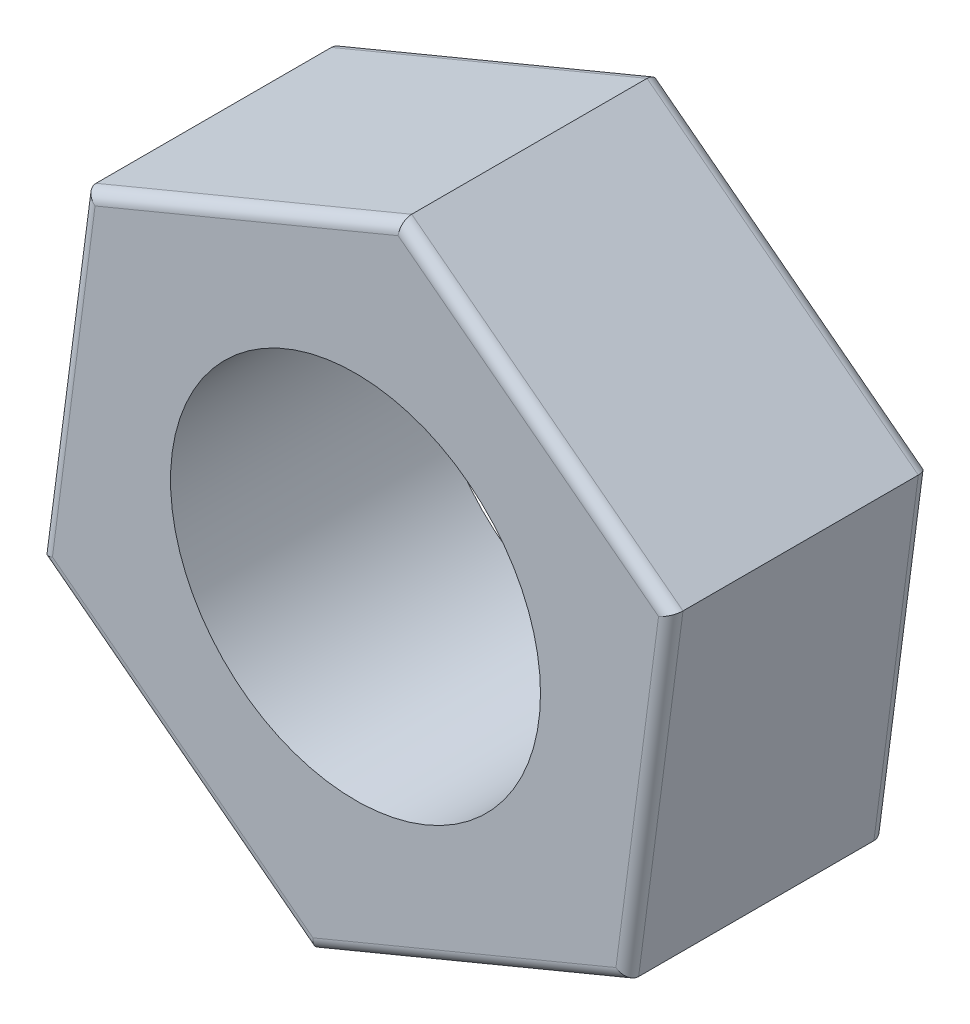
ISO-10303-21;
HEADER;
FILE_DESCRIPTION(('STEP AP214'),'2;1');
FILE_NAME('part.step','',(''),(''),'','','');
FILE_SCHEMA(('AUTOMOTIVE_DESIGN { 1 0 10303 214 1 1 1 1 }'));
ENDSEC;
DATA;
#1=APPLICATION_CONTEXT('core data for automotive mechanical design processes');
#2=APPLICATION_PROTOCOL_DEFINITION('international standard','automotive_design',2000,#1);
#3=PRODUCT_CONTEXT('',#1,'mechanical');
#4=PRODUCT('Part','Part','',(#3));
#5=PRODUCT_RELATED_PRODUCT_CATEGORY('part','',(#4));
#6=PRODUCT_DEFINITION_FORMATION('','',#4);
#7=PRODUCT_DEFINITION_CONTEXT('part definition',#1,'design');
#8=PRODUCT_DEFINITION('design','',#6,#7);
#9=PRODUCT_DEFINITION_SHAPE('','',#8);
#10=(LENGTH_UNIT() NAMED_UNIT(*) SI_UNIT(.MILLI.,.METRE.));
#11=(NAMED_UNIT(*) PLANE_ANGLE_UNIT() SI_UNIT($,.RADIAN.));
#12=(NAMED_UNIT(*) SI_UNIT($,.STERADIAN.) SOLID_ANGLE_UNIT());
#13=UNCERTAINTY_MEASURE_WITH_UNIT(LENGTH_MEASURE(1.E-05),#10,'distance_accuracy_value','');
#14=(GEOMETRIC_REPRESENTATION_CONTEXT(3) GLOBAL_UNCERTAINTY_ASSIGNED_CONTEXT((#13)) GLOBAL_UNIT_ASSIGNED_CONTEXT((#10,
#11,#12)) REPRESENTATION_CONTEXT('',''));
#15=CARTESIAN_POINT('',(0.,0.,0.));
#16=DIRECTION('',(0.,0.,1.));
#17=DIRECTION('',(1.,0.,0.));
#18=AXIS2_PLACEMENT_3D('',#15,#16,#17);
#19=CARTESIAN_POINT('',(5.82021472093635,-4.45964504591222,5.55625));
#20=DIRECTION('',(0.,0.,1.));
#21=DIRECTION('',(1.,0.,0.));
#22=AXIS2_PLACEMENT_3D('',#19,#20,#21);
#23=PLANE('',#22);
#24=DIRECTION('',(0.923615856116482,0.383319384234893,0.));
#25=VECTOR('',#24,1.);
#26=CARTESIAN_POINT('',(5.72285159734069,-4.22504661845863,5.55625));
#27=LINE('',#26,#25);
#28=CARTESIAN_POINT('',(-0.913976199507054,-6.97946527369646,5.55625));
#29=VERTEX_POINT('',#28);
#30=CARTESIAN_POINT('',(5.5874061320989,-4.28125924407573,5.55625));
#31=VERTEX_POINT('',#30);
#32=EDGE_CURVE('E40',#29,#31,#27,.T.);
#33=ORIENTED_EDGE('',*,*,#32,.T.);
#34=DIRECTION('',(0.129843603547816,0.991534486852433,0.));
#35=VECTOR('',#34,1.);
#36=CARTESIAN_POINT('',(6.52042350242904,2.84361155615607,5.55625));
#37=LINE('',#36,#35);
#38=CARTESIAN_POINT('',(6.50138233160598,2.69820602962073,5.55625));
#39=VERTEX_POINT('',#38);
#40=EDGE_CURVE('E11',#31,#39,#37,.T.);
#41=ORIENTED_EDGE('',*,*,#40,.T.);
#42=DIRECTION('',(-0.793772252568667,0.60821510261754,0.));
#43=VECTOR('',#42,1.);
#44=CARTESIAN_POINT('',(0.797571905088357,7.06865817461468,5.55625));
#45=LINE('',#44,#43);
#46=CARTESIAN_POINT('',(0.913976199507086,6.97946527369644,5.55625));
#47=VERTEX_POINT('',#46);
#48=EDGE_CURVE('E155',#39,#47,#45,.T.);
#49=ORIENTED_EDGE('',*,*,#48,.T.);
#50=DIRECTION('',(-0.923615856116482,-0.383319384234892,0.));
#51=VECTOR('',#50,1.);
#52=CARTESIAN_POINT('',(-5.72285159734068,4.2250466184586,5.55625));
#53=LINE('',#52,#51);
#54=CARTESIAN_POINT('',(-5.58740613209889,4.2812592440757,5.55625));
#55=VERTEX_POINT('',#54);
#56=EDGE_CURVE('E253',#47,#55,#53,.T.);
#57=ORIENTED_EDGE('',*,*,#56,.T.);
#58=DIRECTION('',(-0.129843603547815,-0.991534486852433,0.));
#59=VECTOR('',#58,1.);
#60=CARTESIAN_POINT('',(-6.52042350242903,-2.84361155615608,5.55625));
#61=LINE('',#60,#59);
#62=CARTESIAN_POINT('',(-6.50138233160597,-2.69820602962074,5.55625));
#63=VERTEX_POINT('',#62);
#64=EDGE_CURVE('E255',#55,#63,#61,.T.);
#65=ORIENTED_EDGE('',*,*,#64,.T.);
#66=DIRECTION('',(0.793772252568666,-0.608215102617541,0.));
#67=VECTOR('',#66,1.);
#68=CARTESIAN_POINT('',(-0.797571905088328,-7.06865817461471,5.55625));
#69=LINE('',#68,#67);
#70=EDGE_CURVE('E51',#63,#29,#69,.T.);
#71=ORIENTED_EDGE('',*,*,#70,.T.);
#72=EDGE_LOOP('',(#33,#41,#49,#57,#65,#71));
#73=FACE_BOUND('',#72,.T.);
#74=CARTESIAN_POINT('',(0.,0.,5.55625));
#75=DIRECTION('',(0.,0.,1.));
#76=DIRECTION('',(1.,0.,0.));
#77=AXIS2_PLACEMENT_3D('',#74,#75,#76);
#78=CIRCLE('',#77,3.96875);
#79=CARTESIAN_POINT('',(3.96875,0.,5.55625));
#80=VERTEX_POINT('',#79);
#81=EDGE_CURVE('E204',#80,#80,#78,.T.);
#82=ORIENTED_EDGE('',*,*,#81,.F.);
#83=EDGE_LOOP('',(#82));
#84=FACE_BOUND('',#83,.T.);
#85=ADVANCED_FACE('F31',(#73,#84),#23,.T.);
#86=CARTESIAN_POINT('',(5.82021472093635,-4.45964504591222,0.));
#87=DIRECTION('',(0.,0.,1.));
#88=DIRECTION('',(1.,0.,0.));
#89=AXIS2_PLACEMENT_3D('',#86,#87,#88);
#90=PLANE('',#89);
#91=DIRECTION('',(-0.793772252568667,0.60821510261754,0.));
#92=VECTOR('',#91,1.);
#93=CARTESIAN_POINT('',(9.52789398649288,0.379190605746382,0.));
#94=LINE('',#93,#92);
#95=CARTESIAN_POINT('',(0.913976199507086,6.97946527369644,0.));
#96=VERTEX_POINT('',#95);
#97=CARTESIAN_POINT('',(6.50138233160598,2.69820602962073,0.));
#98=VERTEX_POINT('',#97);
#99=EDGE_CURVE('E223',#96,#98,#94,.F.);
#100=ORIENTED_EDGE('',*,*,#99,.T.);
#101=DIRECTION('',(0.129843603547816,0.991534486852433,0.));
#102=VECTOR('',#101,1.);
#103=CARTESIAN_POINT('',(5.56836496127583,-4.42666477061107,0.));
#104=LINE('',#103,#102);
#105=CARTESIAN_POINT('',(5.5874061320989,-4.28125924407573,0.));
#106=VERTEX_POINT('',#105);
#107=EDGE_CURVE('E233',#98,#106,#104,.F.);
#108=ORIENTED_EDGE('',*,*,#107,.T.);
#109=DIRECTION('',(0.923615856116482,0.383319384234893,0.));
#110=VECTOR('',#109,1.);
#111=CARTESIAN_POINT('',(5.72285159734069,-4.22504661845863,0.));
#112=LINE('',#111,#110);
#113=CARTESIAN_POINT('',(-0.913976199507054,-6.97946527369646,0.));
#114=VERTEX_POINT('',#113);
#115=EDGE_CURVE('E231',#106,#114,#112,.F.);
#116=ORIENTED_EDGE('',*,*,#115,.T.);
#117=DIRECTION('',(0.793772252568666,-0.608215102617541,0.));
#118=VECTOR('',#117,1.);
#119=CARTESIAN_POINT('',(2.11253545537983,-9.2984806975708,0.));
#120=LINE('',#119,#118);
#121=CARTESIAN_POINT('',(-6.50138233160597,-2.69820602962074,0.));
#122=VERTEX_POINT('',#121);
#123=EDGE_CURVE('E229',#114,#122,#120,.F.);
#124=ORIENTED_EDGE('',*,*,#123,.T.);
#125=DIRECTION('',(-0.129843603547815,-0.991534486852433,0.));
#126=VECTOR('',#125,1.);
#127=CARTESIAN_POINT('',(-6.52042350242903,-2.84361155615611,0.));
#128=LINE('',#127,#126);
#129=CARTESIAN_POINT('',(-5.58740613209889,4.2812592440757,0.));
#130=VERTEX_POINT('',#129);
#131=EDGE_CURVE('E227',#122,#130,#128,.F.);
#132=ORIENTED_EDGE('',*,*,#131,.T.);
#133=DIRECTION('',(-0.923615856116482,-0.383319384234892,0.));
#134=VECTOR('',#133,1.);
#135=CARTESIAN_POINT('',(1.04942166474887,7.03567789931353,0.));
#136=LINE('',#135,#134);
#137=EDGE_CURVE('E225',#130,#96,#136,.F.);
#138=ORIENTED_EDGE('',*,*,#137,.T.);
#139=EDGE_LOOP('',(#100,#108,#116,#124,#132,#138));
#140=FACE_BOUND('',#139,.T.);
#141=CARTESIAN_POINT('',(0.,0.,0.));
#142=DIRECTION('',(0.,0.,1.));
#143=DIRECTION('',(1.,0.,0.));
#144=AXIS2_PLACEMENT_3D('',#141,#142,#143);
#145=CIRCLE('',#144,3.96875);
#146=CARTESIAN_POINT('',(3.96875,0.,0.));
#147=VERTEX_POINT('',#146);
#148=EDGE_CURVE('E198',#147,#147,#145,.T.);
#149=ORIENTED_EDGE('',*,*,#148,.T.);
#150=EDGE_LOOP('',(#149));
#151=FACE_BOUND('',#150,.T.);
#152=ADVANCED_FACE('F299',(#140,#151),#90,.F.);
#153=CARTESIAN_POINT('',(-0.952058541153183,-7.27027632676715,5.55625));
#154=DIRECTION('',(-0.383319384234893,0.923615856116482,0.));
#155=DIRECTION('',(-0.923615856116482,-0.383319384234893,0.));
#156=AXIS2_PLACEMENT_3D('',#153,#154,#155);
#157=PLANE('',#156);
#158=DIRECTION('',(0.,0.,-1.));
#159=VECTOR('',#158,1.);
#160=CARTESIAN_POINT('',(-0.952058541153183,-7.27027632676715,5.55625));
#161=LINE('',#160,#159);
#162=CARTESIAN_POINT('',(-0.952058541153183,-7.27027632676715,5.30225));
#163=VERTEX_POINT('',#162);
#164=CARTESIAN_POINT('',(-0.952058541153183,-7.27027632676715,0.254));
#165=VERTEX_POINT('',#164);
#166=EDGE_CURVE('E209',#163,#165,#161,.T.);
#167=ORIENTED_EDGE('',*,*,#166,.T.);
#168=DIRECTION('',(0.923615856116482,0.383319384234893,0.));
#169=VECTOR('',#168,1.);
#170=CARTESIAN_POINT('',(-0.952058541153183,-7.27027632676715,0.254));
#171=LINE('',#170,#169);
#172=CARTESIAN_POINT('',(5.82021472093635,-4.45964504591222,0.254));
#173=VERTEX_POINT('',#172);
#174=EDGE_CURVE('E238',#165,#173,#171,.T.);
#175=ORIENTED_EDGE('',*,*,#174,.T.);
#176=DIRECTION('',(0.,0.,-1.));
#177=VECTOR('',#176,1.);
#178=CARTESIAN_POINT('',(5.82021472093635,-4.45964504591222,5.55625));
#179=LINE('',#178,#177);
#180=CARTESIAN_POINT('',(5.82021472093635,-4.45964504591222,5.30225));
#181=VERTEX_POINT('',#180);
#182=EDGE_CURVE('E144',#181,#173,#179,.T.);
#183=ORIENTED_EDGE('',*,*,#182,.F.);
#184=DIRECTION('',(0.923615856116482,0.383319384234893,0.));
#185=VECTOR('',#184,1.);
#186=CARTESIAN_POINT('',(-0.952058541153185,-7.27027632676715,5.30225));
#187=LINE('',#186,#185);
#188=EDGE_CURVE('E236',#181,#163,#187,.F.);
#189=ORIENTED_EDGE('',*,*,#188,.T.);
#190=EDGE_LOOP('',(#167,#175,#183,#189));
#191=FACE_BOUND('',#190,.T.);
#192=ADVANCED_FACE('F282',(#191),#157,.F.);
#193=CARTESIAN_POINT('',(5.82021472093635,-4.45964504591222,5.55625));
#194=DIRECTION('',(-0.991534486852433,0.129843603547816,0.));
#195=DIRECTION('',(-0.129843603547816,-0.991534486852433,0.));
#196=AXIS2_PLACEMENT_3D('',#193,#194,#195);
#197=PLANE('',#196);
#198=ORIENTED_EDGE('',*,*,#182,.T.);
#199=DIRECTION('',(0.129843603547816,0.991534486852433,0.));
#200=VECTOR('',#199,1.);
#201=CARTESIAN_POINT('',(5.82021472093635,-4.45964504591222,0.254));
#202=LINE('',#201,#200);
#203=CARTESIAN_POINT('',(6.77227326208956,2.81063128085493,0.254));
#204=VERTEX_POINT('',#203);
#205=EDGE_CURVE('E143',#173,#204,#202,.T.);
#206=ORIENTED_EDGE('',*,*,#205,.T.);
#207=DIRECTION('',(0.,0.,-1.));
#208=VECTOR('',#207,1.);
#209=CARTESIAN_POINT('',(6.77227326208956,2.81063128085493,5.55625));
#210=LINE('',#209,#208);
#211=CARTESIAN_POINT('',(6.77227326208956,2.81063128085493,5.30225));
#212=VERTEX_POINT('',#211);
#213=EDGE_CURVE('E124',#212,#204,#210,.T.);
#214=ORIENTED_EDGE('',*,*,#213,.F.);
#215=DIRECTION('',(0.129843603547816,0.991534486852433,0.));
#216=VECTOR('',#215,1.);
#217=CARTESIAN_POINT('',(5.82021472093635,-4.45964504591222,5.30225));
#218=LINE('',#217,#216);
#219=EDGE_CURVE('E140',#212,#181,#218,.F.);
#220=ORIENTED_EDGE('',*,*,#219,.T.);
#221=EDGE_LOOP('',(#198,#206,#214,#220));
#222=FACE_BOUND('',#221,.T.);
#223=ADVANCED_FACE('F139',(#222),#197,.F.);
#224=CARTESIAN_POINT('',(6.77227326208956,2.81063128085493,5.55625));
#225=DIRECTION('',(-0.60821510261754,-0.793772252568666,0.));
#226=DIRECTION('',(0.793772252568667,-0.60821510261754,0.));
#227=AXIS2_PLACEMENT_3D('',#224,#225,#226);
#228=PLANE('',#227);
#229=ORIENTED_EDGE('',*,*,#213,.T.);
#230=DIRECTION('',(-0.793772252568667,0.60821510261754,0.));
#231=VECTOR('',#230,1.);
#232=CARTESIAN_POINT('',(6.77227326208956,2.81063128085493,0.254));
#233=LINE('',#232,#231);
#234=CARTESIAN_POINT('',(0.952058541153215,7.27027632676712,0.254));
#235=VERTEX_POINT('',#234);
#236=EDGE_CURVE('E131',#204,#235,#233,.T.);
#237=ORIENTED_EDGE('',*,*,#236,.T.);
#238=DIRECTION('',(0.,0.,-1.));
#239=VECTOR('',#238,1.);
#240=CARTESIAN_POINT('',(0.952058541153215,7.27027632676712,5.55625));
#241=LINE('',#240,#239);
#242=CARTESIAN_POINT('',(0.952058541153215,7.27027632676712,5.30225));
#243=VERTEX_POINT('',#242);
#244=EDGE_CURVE('E126',#243,#235,#241,.T.);
#245=ORIENTED_EDGE('',*,*,#244,.F.);
#246=DIRECTION('',(-0.793772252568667,0.60821510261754,0.));
#247=VECTOR('',#246,1.);
#248=CARTESIAN_POINT('',(6.77227326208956,2.81063128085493,5.30225));
#249=LINE('',#248,#247);
#250=EDGE_CURVE('E121',#243,#212,#249,.F.);
#251=ORIENTED_EDGE('',*,*,#250,.T.);
#252=EDGE_LOOP('',(#229,#237,#245,#251));
#253=FACE_BOUND('',#252,.T.);
#254=ADVANCED_FACE('F123',(#253),#228,.F.);
#255=CARTESIAN_POINT('',(0.952058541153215,7.27027632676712,5.55625));
#256=DIRECTION('',(0.383319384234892,-0.923615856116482,0.));
#257=DIRECTION('',(0.923615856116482,0.383319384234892,0.));
#258=AXIS2_PLACEMENT_3D('',#255,#256,#257);
#259=PLANE('',#258);
#260=ORIENTED_EDGE('',*,*,#244,.T.);
#261=DIRECTION('',(-0.923615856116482,-0.383319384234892,0.));
#262=VECTOR('',#261,1.);
#263=CARTESIAN_POINT('',(0.952058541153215,7.27027632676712,0.254));
#264=LINE('',#263,#262);
#265=CARTESIAN_POINT('',(-5.82021472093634,4.45964504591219,0.254));
#266=VERTEX_POINT('',#265);
#267=EDGE_CURVE('E132',#235,#266,#264,.T.);
#268=ORIENTED_EDGE('',*,*,#267,.T.);
#269=DIRECTION('',(0.,0.,-1.));
#270=VECTOR('',#269,1.);
#271=CARTESIAN_POINT('',(-5.82021472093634,4.45964504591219,5.55625));
#272=LINE('',#271,#270);
#273=CARTESIAN_POINT('',(-5.82021472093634,4.45964504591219,5.30225));
#274=VERTEX_POINT('',#273);
#275=EDGE_CURVE('E217',#274,#266,#272,.T.);
#276=ORIENTED_EDGE('',*,*,#275,.F.);
#277=DIRECTION('',(-0.923615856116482,-0.383319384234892,0.));
#278=VECTOR('',#277,1.);
#279=CARTESIAN_POINT('',(0.952058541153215,7.27027632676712,5.30225));
#280=LINE('',#279,#278);
#281=EDGE_CURVE('E248',#274,#243,#280,.F.);
#282=ORIENTED_EDGE('',*,*,#281,.T.);
#283=EDGE_LOOP('',(#260,#268,#276,#282));
#284=FACE_BOUND('',#283,.T.);
#285=ADVANCED_FACE('F267',(#284),#259,.F.);
#286=CARTESIAN_POINT('',(-5.82021472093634,4.45964504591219,5.55625));
#287=DIRECTION('',(0.991534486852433,-0.129843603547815,0.));
#288=DIRECTION('',(0.129843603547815,0.991534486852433,0.));
#289=AXIS2_PLACEMENT_3D('',#286,#287,#288);
#290=PLANE('',#289);
#291=ORIENTED_EDGE('',*,*,#275,.T.);
#292=DIRECTION('',(-0.129843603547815,-0.991534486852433,0.));
#293=VECTOR('',#292,1.);
#294=CARTESIAN_POINT('',(-5.82021472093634,4.45964504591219,0.254));
#295=LINE('',#294,#293);
#296=CARTESIAN_POINT('',(-6.77227326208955,-2.81063128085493,0.254));
#297=VERTEX_POINT('',#296);
#298=EDGE_CURVE('E246',#266,#297,#295,.T.);
#299=ORIENTED_EDGE('',*,*,#298,.T.);
#300=DIRECTION('',(0.,0.,-1.));
#301=VECTOR('',#300,1.);
#302=CARTESIAN_POINT('',(-6.77227326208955,-2.81063128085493,5.55625));
#303=LINE('',#302,#301);
#304=CARTESIAN_POINT('',(-6.77227326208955,-2.81063128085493,5.30225));
#305=VERTEX_POINT('',#304);
#306=EDGE_CURVE('E214',#305,#297,#303,.T.);
#307=ORIENTED_EDGE('',*,*,#306,.F.);
#308=DIRECTION('',(-0.129843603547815,-0.991534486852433,0.));
#309=VECTOR('',#308,1.);
#310=CARTESIAN_POINT('',(-5.82021472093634,4.45964504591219,5.30225));
#311=LINE('',#310,#309);
#312=EDGE_CURVE('E244',#305,#274,#311,.F.);
#313=ORIENTED_EDGE('',*,*,#312,.T.);
#314=EDGE_LOOP('',(#291,#299,#307,#313));
#315=FACE_BOUND('',#314,.T.);
#316=ADVANCED_FACE('F270',(#315),#290,.F.);
#317=CARTESIAN_POINT('',(-6.77227326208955,-2.81063128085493,5.55625));
#318=DIRECTION('',(0.60821510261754,0.793772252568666,0.));
#319=DIRECTION('',(-0.793772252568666,0.608215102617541,0.));
#320=AXIS2_PLACEMENT_3D('',#317,#318,#319);
#321=PLANE('',#320);
#322=ORIENTED_EDGE('',*,*,#306,.T.);
#323=DIRECTION('',(0.793772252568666,-0.608215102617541,0.));
#324=VECTOR('',#323,1.);
#325=CARTESIAN_POINT('',(-6.77227326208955,-2.81063128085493,0.254));
#326=LINE('',#325,#324);
#327=EDGE_CURVE('E242',#297,#165,#326,.T.);
#328=ORIENTED_EDGE('',*,*,#327,.T.);
#329=ORIENTED_EDGE('',*,*,#166,.F.);
#330=DIRECTION('',(0.793772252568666,-0.608215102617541,0.));
#331=VECTOR('',#330,1.);
#332=CARTESIAN_POINT('',(-6.77227326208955,-2.81063128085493,5.30225));
#333=LINE('',#332,#331);
#334=EDGE_CURVE('E240',#163,#305,#333,.F.);
#335=ORIENTED_EDGE('',*,*,#334,.T.);
#336=EDGE_LOOP('',(#322,#328,#329,#335));
#337=FACE_BOUND('',#336,.T.);
#338=ADVANCED_FACE('F280',(#337),#321,.F.);
#339=CARTESIAN_POINT('',(0.,0.,5.55625));
#340=DIRECTION('',(0.,0.,-1.));
#341=DIRECTION('',(-1.,0.,0.));
#342=AXIS2_PLACEMENT_3D('',#339,#340,#341);
#343=CYLINDRICAL_SURFACE('',#342,3.96875);
#344=ORIENTED_EDGE('',*,*,#81,.T.);
#345=EDGE_LOOP('',(#344));
#346=FACE_BOUND('',#345,.T.);
#347=ORIENTED_EDGE('',*,*,#148,.F.);
#348=EDGE_LOOP('',(#347));
#349=FACE_BOUND('',#348,.T.);
#350=ADVANCED_FACE('F307',(#346,#349),#343,.F.);
#351=CARTESIAN_POINT('',(-5.56836496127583,4.42666477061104,0.254));
#352=DIRECTION('',(-0.129843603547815,-0.991534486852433,0.));
#353=DIRECTION('',(0.991534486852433,-0.129843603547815,0.));
#354=AXIS2_PLACEMENT_3D('',#351,#352,#353);
#355=CYLINDRICAL_SURFACE('',#354,0.254);
#356=CARTESIAN_POINT('',(-5.58740613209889,4.2812592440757,0.254));
#357=DIRECTION('',(-0.60821510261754,-0.793772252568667,0.));
#358=DIRECTION('',(-0.793772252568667,0.60821510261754,0.));
#359=AXIS2_PLACEMENT_3D('',#356,#357,#358);
#360=ELLIPSE('',#359,0.29329393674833,0.254);
#361=EDGE_CURVE('E191',#130,#266,#360,.F.);
#362=ORIENTED_EDGE('',*,*,#361,.F.);
#363=ORIENTED_EDGE('',*,*,#131,.F.);
#364=CARTESIAN_POINT('',(-6.50138233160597,-2.69820602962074,0.254));
#365=DIRECTION('',(0.383319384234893,-0.923615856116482,0.));
#366=DIRECTION('',(-0.923615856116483,-0.383319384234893,0.));
#367=AXIS2_PLACEMENT_3D('',#364,#365,#366);
#368=ELLIPSE('',#367,0.29329393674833,0.254);
#369=EDGE_CURVE('E160',#297,#122,#368,.T.);
#370=ORIENTED_EDGE('',*,*,#369,.F.);
#371=ORIENTED_EDGE('',*,*,#298,.F.);
#372=EDGE_LOOP('',(#362,#363,#370,#371));
#373=FACE_BOUND('',#372,.T.);
#374=ADVANCED_FACE('F273',(#373),#355,.T.);
#375=CARTESIAN_POINT('',(-6.61778662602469,-2.60901312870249,0.254));
#376=DIRECTION('',(0.793772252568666,-0.608215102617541,0.));
#377=DIRECTION('',(0.608215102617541,0.793772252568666,0.));
#378=AXIS2_PLACEMENT_3D('',#375,#376,#377);
#379=CYLINDRICAL_SURFACE('',#378,0.254);
#380=ORIENTED_EDGE('',*,*,#369,.T.);
#381=ORIENTED_EDGE('',*,*,#123,.F.);
#382=CARTESIAN_POINT('',(-0.913976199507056,-6.97946527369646,0.254));
#383=DIRECTION('',(0.991534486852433,-0.129843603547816,0.));
#384=DIRECTION('',(-0.129843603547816,-0.991534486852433,0.));
#385=AXIS2_PLACEMENT_3D('',#382,#383,#384);
#386=ELLIPSE('',#385,0.29329393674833,0.254);
#387=EDGE_CURVE('E189',#165,#114,#386,.T.);
#388=ORIENTED_EDGE('',*,*,#387,.F.);
#389=ORIENTED_EDGE('',*,*,#327,.F.);
#390=EDGE_LOOP('',(#380,#381,#388,#389));
#391=FACE_BOUND('',#390,.T.);
#392=ADVANCED_FACE('F276',(#391),#379,.T.);
#393=CARTESIAN_POINT('',(1.04942166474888,7.03567789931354,0.254));
#394=DIRECTION('',(-0.923615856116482,-0.383319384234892,0.));
#395=DIRECTION('',(0.383319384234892,-0.923615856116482,0.));
#396=AXIS2_PLACEMENT_3D('',#393,#394,#395);
#397=CYLINDRICAL_SURFACE('',#396,0.254);
#398=ORIENTED_EDGE('',*,*,#361,.T.);
#399=ORIENTED_EDGE('',*,*,#267,.F.);
#400=CARTESIAN_POINT('',(0.913976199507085,6.97946527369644,0.254));
#401=DIRECTION('',(-0.991534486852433,0.129843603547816,0.));
#402=DIRECTION('',(0.129843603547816,0.991534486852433,0.));
#403=AXIS2_PLACEMENT_3D('',#400,#401,#402);
#404=ELLIPSE('',#403,0.29329393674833,0.254);
#405=EDGE_CURVE('E183',#96,#235,#404,.F.);
#406=ORIENTED_EDGE('',*,*,#405,.F.);
#407=ORIENTED_EDGE('',*,*,#137,.F.);
#408=EDGE_LOOP('',(#398,#399,#406,#407));
#409=FACE_BOUND('',#408,.T.);
#410=ADVANCED_FACE('F361',(#409),#397,.T.);
#411=CARTESIAN_POINT('',(-1.04942166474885,-7.03567789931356,0.254));
#412=DIRECTION('',(0.923615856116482,0.383319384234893,0.));
#413=DIRECTION('',(-0.383319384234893,0.923615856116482,0.));
#414=AXIS2_PLACEMENT_3D('',#411,#412,#413);
#415=CYLINDRICAL_SURFACE('',#414,0.254);
#416=ORIENTED_EDGE('',*,*,#387,.T.);
#417=ORIENTED_EDGE('',*,*,#115,.F.);
#418=CARTESIAN_POINT('',(5.58740613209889,-4.28125924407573,0.254));
#419=DIRECTION('',(0.60821510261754,0.793772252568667,0.));
#420=DIRECTION('',(0.793772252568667,-0.60821510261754,0.));
#421=AXIS2_PLACEMENT_3D('',#418,#419,#420);
#422=ELLIPSE('',#421,0.29329393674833,0.254);
#423=EDGE_CURVE('E177',#173,#106,#422,.T.);
#424=ORIENTED_EDGE('',*,*,#423,.F.);
#425=ORIENTED_EDGE('',*,*,#174,.F.);
#426=EDGE_LOOP('',(#416,#417,#424,#425));
#427=FACE_BOUND('',#426,.T.);
#428=ADVANCED_FACE('F286',(#427),#415,.T.);
#429=CARTESIAN_POINT('',(6.61778662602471,2.60901312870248,0.254));
#430=DIRECTION('',(-0.793772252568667,0.60821510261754,0.));
#431=DIRECTION('',(-0.60821510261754,-0.793772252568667,0.));
#432=AXIS2_PLACEMENT_3D('',#429,#430,#431);
#433=CYLINDRICAL_SURFACE('',#432,0.254);
#434=ORIENTED_EDGE('',*,*,#405,.T.);
#435=ORIENTED_EDGE('',*,*,#236,.F.);
#436=CARTESIAN_POINT('',(6.50138233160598,2.69820602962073,0.254));
#437=DIRECTION('',(-0.383319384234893,0.923615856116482,0.));
#438=DIRECTION('',(-0.923615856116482,-0.383319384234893,0.));
#439=AXIS2_PLACEMENT_3D('',#436,#437,#438);
#440=ELLIPSE('',#439,0.29329393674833,0.254);
#441=EDGE_CURVE('E173',#98,#204,#440,.F.);
#442=ORIENTED_EDGE('',*,*,#441,.F.);
#443=ORIENTED_EDGE('',*,*,#99,.F.);
#444=EDGE_LOOP('',(#434,#435,#442,#443));
#445=FACE_BOUND('',#444,.T.);
#446=ADVANCED_FACE('F289',(#445),#433,.T.);
#447=CARTESIAN_POINT('',(5.56836496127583,-4.42666477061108,0.254));
#448=DIRECTION('',(0.129843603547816,0.991534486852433,0.));
#449=DIRECTION('',(-0.991534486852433,0.129843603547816,0.));
#450=AXIS2_PLACEMENT_3D('',#447,#448,#449);
#451=CYLINDRICAL_SURFACE('',#450,0.254);
#452=ORIENTED_EDGE('',*,*,#423,.T.);
#453=ORIENTED_EDGE('',*,*,#107,.F.);
#454=ORIENTED_EDGE('',*,*,#441,.T.);
#455=ORIENTED_EDGE('',*,*,#205,.F.);
#456=EDGE_LOOP('',(#452,#453,#454,#455));
#457=FACE_BOUND('',#456,.T.);
#458=ADVANCED_FACE('F287',(#457),#451,.T.);
#459=CARTESIAN_POINT('',(-6.52042350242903,-2.84361155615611,5.30225));
#460=DIRECTION('',(0.129843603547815,0.991534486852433,0.));
#461=DIRECTION('',(-0.991534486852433,0.129843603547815,0.));
#462=AXIS2_PLACEMENT_3D('',#459,#460,#461);
#463=CYLINDRICAL_SURFACE('',#462,0.254);
#464=CARTESIAN_POINT('',(-5.58740613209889,4.2812592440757,5.30225));
#465=DIRECTION('',(0.60821510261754,0.793772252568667,0.));
#466=DIRECTION('',(0.793772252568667,-0.60821510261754,0.));
#467=AXIS2_PLACEMENT_3D('',#464,#465,#466);
#468=ELLIPSE('',#467,0.29329393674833,0.254);
#469=EDGE_CURVE('E166',#274,#55,#468,.T.);
#470=ORIENTED_EDGE('',*,*,#469,.F.);
#471=ORIENTED_EDGE('',*,*,#312,.F.);
#472=CARTESIAN_POINT('',(-6.50138233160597,-2.69820602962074,5.30225));
#473=DIRECTION('',(-0.383319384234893,0.923615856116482,0.));
#474=DIRECTION('',(0.923615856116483,0.383319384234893,0.));
#475=AXIS2_PLACEMENT_3D('',#472,#473,#474);
#476=ELLIPSE('',#475,0.29329393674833,0.254);
#477=EDGE_CURVE('E35',#63,#305,#476,.F.);
#478=ORIENTED_EDGE('',*,*,#477,.F.);
#479=ORIENTED_EDGE('',*,*,#64,.F.);
#480=EDGE_LOOP('',(#470,#471,#478,#479));
#481=FACE_BOUND('',#480,.T.);
#482=ADVANCED_FACE('F33',(#481),#463,.T.);
#483=CARTESIAN_POINT('',(2.11253545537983,-9.2984806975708,5.30225));
#484=DIRECTION('',(-0.793772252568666,0.608215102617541,0.));
#485=DIRECTION('',(-0.608215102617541,-0.793772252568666,0.));
#486=AXIS2_PLACEMENT_3D('',#483,#484,#485);
#487=CYLINDRICAL_SURFACE('',#486,0.254);
#488=ORIENTED_EDGE('',*,*,#477,.T.);
#489=ORIENTED_EDGE('',*,*,#334,.F.);
#490=CARTESIAN_POINT('',(-0.913976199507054,-6.97946527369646,5.30225));
#491=DIRECTION('',(-0.991534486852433,0.129843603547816,0.));
#492=DIRECTION('',(0.129843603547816,0.991534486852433,0.));
#493=AXIS2_PLACEMENT_3D('',#490,#491,#492);
#494=ELLIPSE('',#493,0.29329393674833,0.254);
#495=EDGE_CURVE('E164',#29,#163,#494,.F.);
#496=ORIENTED_EDGE('',*,*,#495,.F.);
#497=ORIENTED_EDGE('',*,*,#70,.F.);
#498=EDGE_LOOP('',(#488,#489,#496,#497));
#499=FACE_BOUND('',#498,.T.);
#500=ADVANCED_FACE('F261',(#499),#487,.T.);
#501=CARTESIAN_POINT('',(1.04942166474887,7.03567789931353,5.30225));
#502=DIRECTION('',(0.923615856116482,0.383319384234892,0.));
#503=DIRECTION('',(-0.383319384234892,0.923615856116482,0.));
#504=AXIS2_PLACEMENT_3D('',#501,#502,#503);
#505=CYLINDRICAL_SURFACE('',#504,0.254);
#506=ORIENTED_EDGE('',*,*,#469,.T.);
#507=ORIENTED_EDGE('',*,*,#56,.F.);
#508=CARTESIAN_POINT('',(0.913976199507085,6.97946527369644,5.30225));
#509=DIRECTION('',(0.991534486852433,-0.129843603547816,0.));
#510=DIRECTION('',(-0.129843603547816,-0.991534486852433,0.));
#511=AXIS2_PLACEMENT_3D('',#508,#509,#510);
#512=ELLIPSE('',#511,0.29329393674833,0.254);
#513=EDGE_CURVE('E157',#243,#47,#512,.T.);
#514=ORIENTED_EDGE('',*,*,#513,.F.);
#515=ORIENTED_EDGE('',*,*,#281,.F.);
#516=EDGE_LOOP('',(#506,#507,#514,#515));
#517=FACE_BOUND('',#516,.T.);
#518=ADVANCED_FACE('F264',(#517),#505,.T.);
#519=CARTESIAN_POINT('',(5.72285159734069,-4.22504661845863,5.30225));
#520=DIRECTION('',(-0.923615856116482,-0.383319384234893,0.));
#521=DIRECTION('',(0.383319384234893,-0.923615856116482,0.));
#522=AXIS2_PLACEMENT_3D('',#519,#520,#521);
#523=CYLINDRICAL_SURFACE('',#522,0.254);
#524=ORIENTED_EDGE('',*,*,#495,.T.);
#525=ORIENTED_EDGE('',*,*,#188,.F.);
#526=CARTESIAN_POINT('',(5.5874061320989,-4.28125924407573,5.30225));
#527=DIRECTION('',(-0.60821510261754,-0.793772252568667,0.));
#528=DIRECTION('',(-0.793772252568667,0.60821510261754,0.));
#529=AXIS2_PLACEMENT_3D('',#526,#527,#528);
#530=ELLIPSE('',#529,0.29329393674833,0.254);
#531=EDGE_CURVE('E151',#31,#181,#530,.F.);
#532=ORIENTED_EDGE('',*,*,#531,.F.);
#533=ORIENTED_EDGE('',*,*,#32,.F.);
#534=EDGE_LOOP('',(#524,#525,#532,#533));
#535=FACE_BOUND('',#534,.T.);
#536=ADVANCED_FACE('F263',(#535),#523,.T.);
#537=CARTESIAN_POINT('',(9.52789398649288,0.379190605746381,5.30225));
#538=DIRECTION('',(0.793772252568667,-0.60821510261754,0.));
#539=DIRECTION('',(0.60821510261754,0.793772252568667,0.));
#540=AXIS2_PLACEMENT_3D('',#537,#538,#539);
#541=CYLINDRICAL_SURFACE('',#540,0.254);
#542=ORIENTED_EDGE('',*,*,#513,.T.);
#543=ORIENTED_EDGE('',*,*,#48,.F.);
#544=CARTESIAN_POINT('',(6.50138233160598,2.69820602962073,5.30225));
#545=DIRECTION('',(0.383319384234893,-0.923615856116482,0.));
#546=DIRECTION('',(0.923615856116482,0.383319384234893,0.));
#547=AXIS2_PLACEMENT_3D('',#544,#545,#546);
#548=ELLIPSE('',#547,0.29329393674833,0.254);
#549=EDGE_CURVE('E149',#212,#39,#548,.T.);
#550=ORIENTED_EDGE('',*,*,#549,.F.);
#551=ORIENTED_EDGE('',*,*,#250,.F.);
#552=EDGE_LOOP('',(#542,#543,#550,#551));
#553=FACE_BOUND('',#552,.T.);
#554=ADVANCED_FACE('F154',(#553),#541,.T.);
#555=CARTESIAN_POINT('',(5.56836496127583,-4.42666477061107,5.30225));
#556=DIRECTION('',(-0.129843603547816,-0.991534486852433,0.));
#557=DIRECTION('',(0.991534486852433,-0.129843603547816,0.));
#558=AXIS2_PLACEMENT_3D('',#555,#556,#557);
#559=CYLINDRICAL_SURFACE('',#558,0.254);
#560=ORIENTED_EDGE('',*,*,#531,.T.);
#561=ORIENTED_EDGE('',*,*,#219,.F.);
#562=ORIENTED_EDGE('',*,*,#549,.T.);
#563=ORIENTED_EDGE('',*,*,#40,.F.);
#564=EDGE_LOOP('',(#560,#561,#562,#563));
#565=FACE_BOUND('',#564,.T.);
#566=ADVANCED_FACE('F147',(#565),#559,.T.);
#567=CLOSED_SHELL('',(#85,#152,#192,#223,#254,#285,#316,#338,#350,#374,#392,#410,#428,#446,#458,
#482,#500,#518,#536,#554,#566));
#568=MANIFOLD_SOLID_BREP('B2',#567);
#569=ADVANCED_BREP_SHAPE_REPRESENTATION('',(#18,#568),#14);
#570=SHAPE_DEFINITION_REPRESENTATION(#9,#569);
ENDSEC;
END-ISO-10303-21;
